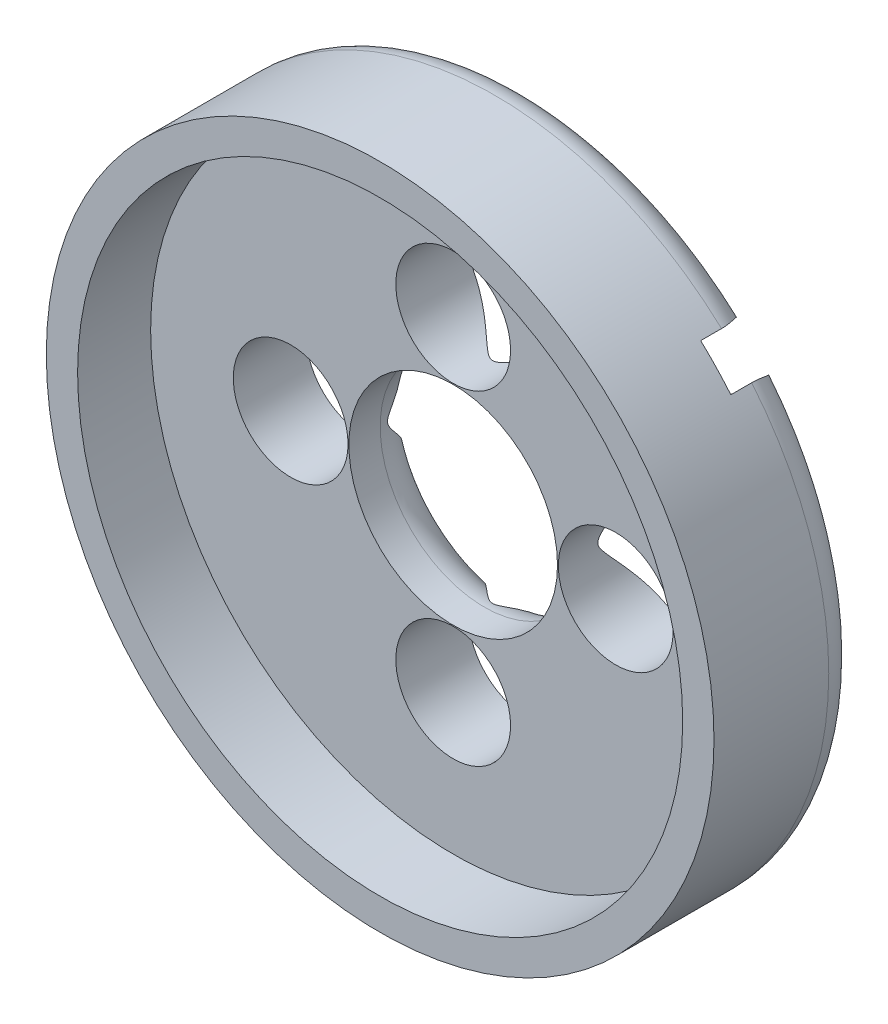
ISO-10303-21;
HEADER;
FILE_DESCRIPTION(('STEP AP214'),'2;1');
FILE_NAME('part.step','',(''),(''),'','','');
FILE_SCHEMA(('AUTOMOTIVE_DESIGN { 1 0 10303 214 1 1 1 1 }'));
ENDSEC;
DATA;
#1=APPLICATION_CONTEXT('core data for automotive mechanical design processes');
#2=APPLICATION_PROTOCOL_DEFINITION('international standard','automotive_design',2000,#1);
#3=PRODUCT_CONTEXT('',#1,'mechanical');
#4=PRODUCT('Part','Part','',(#3));
#5=PRODUCT_RELATED_PRODUCT_CATEGORY('part','',(#4));
#6=PRODUCT_DEFINITION_FORMATION('','',#4);
#7=PRODUCT_DEFINITION_CONTEXT('part definition',#1,'design');
#8=PRODUCT_DEFINITION('design','',#6,#7);
#9=PRODUCT_DEFINITION_SHAPE('','',#8);
#10=(LENGTH_UNIT() NAMED_UNIT(*) SI_UNIT(.MILLI.,.METRE.));
#11=(NAMED_UNIT(*) PLANE_ANGLE_UNIT() SI_UNIT($,.RADIAN.));
#12=(NAMED_UNIT(*) SI_UNIT($,.STERADIAN.) SOLID_ANGLE_UNIT());
#13=UNCERTAINTY_MEASURE_WITH_UNIT(LENGTH_MEASURE(1.E-05),#10,'distance_accuracy_value','');
#14=(GEOMETRIC_REPRESENTATION_CONTEXT(3) GLOBAL_UNCERTAINTY_ASSIGNED_CONTEXT((#13)) GLOBAL_UNIT_ASSIGNED_CONTEXT((#10,
#11,#12)) REPRESENTATION_CONTEXT('',''));
#15=CARTESIAN_POINT('',(0.,0.,0.));
#16=DIRECTION('',(0.,0.,1.));
#17=DIRECTION('',(1.,0.,0.));
#18=AXIS2_PLACEMENT_3D('',#15,#16,#17);
#19=CARTESIAN_POINT('',(0.,0.,0.));
#20=DIRECTION('',(0.,0.,1.));
#21=DIRECTION('',(1.,0.,0.));
#22=AXIS2_PLACEMENT_3D('',#19,#20,#21);
#23=PLANE('',#22);
#24=CARTESIAN_POINT('',(0.,0.,0.));
#25=DIRECTION('',(0.,0.,1.));
#26=DIRECTION('',(1.,0.,0.));
#27=AXIS2_PLACEMENT_3D('',#24,#25,#26);
#28=CIRCLE('',#27,10.);
#29=CARTESIAN_POINT('',(10.,0.,0.));
#30=VERTEX_POINT('',#29);
#31=EDGE_CURVE('E210',#30,#30,#28,.T.);
#32=ORIENTED_EDGE('',*,*,#31,.F.);
#33=EDGE_LOOP('',(#32));
#34=FACE_BOUND('',#33,.T.);
#35=CARTESIAN_POINT('',(0.,15.5782327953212,0.));
#36=DIRECTION('',(0.,0.,1.));
#37=DIRECTION('',(1.,0.,0.));
#38=AXIS2_PLACEMENT_3D('',#35,#36,#37);
#39=CIRCLE('',#38,5.5);
#40=CARTESIAN_POINT('',(5.5,15.5782327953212,0.));
#41=VERTEX_POINT('',#40);
#42=EDGE_CURVE('E204',#41,#41,#39,.T.);
#43=ORIENTED_EDGE('',*,*,#42,.F.);
#44=EDGE_LOOP('',(#43));
#45=FACE_BOUND('',#44,.T.);
#46=CARTESIAN_POINT('',(15.5782327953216,4.40852222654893E-13,0.));
#47=DIRECTION('',(0.,0.,1.));
#48=DIRECTION('',(1.,0.,0.));
#49=AXIS2_PLACEMENT_3D('',#46,#47,#48);
#50=CIRCLE('',#49,5.5);
#51=CARTESIAN_POINT('',(21.0782327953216,4.40852222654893E-13,0.));
#52=VERTEX_POINT('',#51);
#53=EDGE_CURVE('E198',#52,#52,#50,.T.);
#54=ORIENTED_EDGE('',*,*,#53,.F.);
#55=EDGE_LOOP('',(#54));
#56=FACE_BOUND('',#55,.T.);
#57=CARTESIAN_POINT('',(8.81704445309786E-13,-15.5782327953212,0.));
#58=DIRECTION('',(0.,0.,1.));
#59=DIRECTION('',(1.,0.,0.));
#60=AXIS2_PLACEMENT_3D('',#57,#58,#59);
#61=CIRCLE('',#60,5.5);
#62=CARTESIAN_POINT('',(5.50000000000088,-15.5782327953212,0.));
#63=VERTEX_POINT('',#62);
#64=EDGE_CURVE('E191',#63,#63,#61,.T.);
#65=ORIENTED_EDGE('',*,*,#64,.F.);
#66=EDGE_LOOP('',(#65));
#67=FACE_BOUND('',#66,.T.);
#68=CARTESIAN_POINT('',(-15.5782327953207,-4.42760005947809E-13,0.));
#69=DIRECTION('',(0.,0.,1.));
#70=DIRECTION('',(1.,0.,0.));
#71=AXIS2_PLACEMENT_3D('',#68,#69,#70);
#72=CIRCLE('',#71,5.5);
#73=CARTESIAN_POINT('',(-10.0782327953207,-4.42760005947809E-13,0.));
#74=VERTEX_POINT('',#73);
#75=EDGE_CURVE('E192',#74,#74,#72,.T.);
#76=ORIENTED_EDGE('',*,*,#75,.F.);
#77=EDGE_LOOP('',(#76));
#78=FACE_BOUND('',#77,.T.);
#79=CARTESIAN_POINT('',(18.5310177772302,17.4350973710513,0.));
#80=DIRECTION('',(0.,0.,1.));
#81=DIRECTION('',(1.,0.,0.));
#82=AXIS2_PLACEMENT_3D('',#79,#80,#81);
#83=CIRCLE('',#82,1.9999999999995);
#84=CARTESIAN_POINT('',(20.5310177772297,17.4350973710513,0.));
#85=VERTEX_POINT('',#84);
#86=EDGE_CURVE('E187',#85,#85,#83,.T.);
#87=ORIENTED_EDGE('',*,*,#86,.F.);
#88=EDGE_LOOP('',(#87));
#89=FACE_BOUND('',#88,.T.);
#90=CARTESIAN_POINT('',(0.,0.,0.));
#91=DIRECTION('',(0.,0.,1.));
#92=DIRECTION('',(1.,0.,0.));
#93=AXIS2_PLACEMENT_3D('',#90,#91,#92);
#94=CIRCLE('',#93,29.);
#95=CARTESIAN_POINT('',(29.,0.,0.));
#96=VERTEX_POINT('',#95);
#97=EDGE_CURVE('E223',#96,#96,#94,.F.);
#98=ORIENTED_EDGE('',*,*,#97,.F.);
#99=EDGE_LOOP('',(#98));
#100=FACE_BOUND('',#99,.T.);
#101=ADVANCED_FACE('F33',(#34,#45,#56,#67,#78,#89,#100),#23,.T.);
#102=CARTESIAN_POINT('',(0.,0.,-6.99999999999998));
#103=DIRECTION('',(0.,0.,1.));
#104=DIRECTION('',(1.,0.,0.));
#105=AXIS2_PLACEMENT_3D('',#102,#103,#104);
#106=CYLINDRICAL_SURFACE('',#105,32.);
#107=DIRECTION('',(0.,0.,-1.));
#108=VECTOR('',#107,1.);
#109=CARTESIAN_POINT('',(21.7247211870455,23.4954567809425,-4.49999999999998));
#110=LINE('',#109,#108);
#111=CARTESIAN_POINT('',(21.7247211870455,23.4954567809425,-3.99999999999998));
#112=VERTEX_POINT('',#111);
#113=CARTESIAN_POINT('',(21.7247211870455,23.4954567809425,-1.99999999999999));
#114=VERTEX_POINT('',#113);
#115=EDGE_CURVE('E182',#112,#114,#110,.F.);
#116=ORIENTED_EDGE('',*,*,#115,.F.);
#117=CARTESIAN_POINT('',(0.,0.,-3.99999999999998));
#118=DIRECTION('',(0.,0.,1.));
#119=DIRECTION('',(1.,0.,0.));
#120=AXIS2_PLACEMENT_3D('',#117,#118,#119);
#121=CIRCLE('',#120,32.);
#122=CARTESIAN_POINT('',(24.6149607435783,20.4475843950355,-3.99999999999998));
#123=VERTEX_POINT('',#122);
#124=EDGE_CURVE('E283',#112,#123,#121,.T.);
#125=ORIENTED_EDGE('',*,*,#124,.T.);
#126=DIRECTION('',(0.,0.,-1.));
#127=VECTOR('',#126,1.);
#128=CARTESIAN_POINT('',(24.6149607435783,20.4475843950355,-4.49999999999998));
#129=LINE('',#128,#127);
#130=CARTESIAN_POINT('',(24.6149607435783,20.4475843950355,-1.99999999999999));
#131=VERTEX_POINT('',#130);
#132=EDGE_CURVE('E179',#131,#123,#129,.T.);
#133=ORIENTED_EDGE('',*,*,#132,.F.);
#134=CARTESIAN_POINT('',(0.,0.,-1.99999999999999));
#135=DIRECTION('',(0.,0.,-1.));
#136=DIRECTION('',(-1.,0.,0.));
#137=AXIS2_PLACEMENT_3D('',#134,#135,#136);
#138=CIRCLE('',#137,32.);
#139=EDGE_CURVE('E172',#131,#114,#138,.F.);
#140=ORIENTED_EDGE('',*,*,#139,.T.);
#141=EDGE_LOOP('',(#116,#125,#133,#140));
#142=FACE_BOUND('',#141,.T.);
#143=CARTESIAN_POINT('',(0.,0.,7.));
#144=DIRECTION('',(0.,0.,1.));
#145=DIRECTION('',(1.,0.,0.));
#146=AXIS2_PLACEMENT_3D('',#143,#144,#145);
#147=CIRCLE('',#146,32.);
#148=CARTESIAN_POINT('',(32.,0.,7.));
#149=VERTEX_POINT('',#148);
#150=EDGE_CURVE('E335',#149,#149,#147,.T.);
#151=ORIENTED_EDGE('',*,*,#150,.F.);
#152=EDGE_LOOP('',(#151));
#153=FACE_BOUND('',#152,.T.);
#154=ADVANCED_FACE('F327',(#142,#153),#106,.T.);
#155=CARTESIAN_POINT('',(0.,0.,-6.99999999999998));
#156=DIRECTION('',(0.,0.,1.));
#157=DIRECTION('',(1.,0.,0.));
#158=AXIS2_PLACEMENT_3D('',#155,#156,#157);
#159=PLANE('',#158);
#160=CARTESIAN_POINT('',(0.,15.5782327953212,-6.99999999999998));
#161=DIRECTION('',(0.,0.,1.));
#162=DIRECTION('',(1.,0.,0.));
#163=AXIS2_PLACEMENT_3D('',#160,#161,#162);
#164=CIRCLE('',#163,5.5);
#165=CARTESIAN_POINT('',(4.91457875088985,13.1090394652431,-6.99999999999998));
#166=VERTEX_POINT('',#165);
#167=CARTESIAN_POINT('',(-4.91457875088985,13.1090394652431,-6.99999999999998));
#168=VERTEX_POINT('',#167);
#169=EDGE_CURVE('E207',#166,#168,#164,.T.);
#170=ORIENTED_EDGE('',*,*,#169,.T.);
#171=CARTESIAN_POINT('',(0.,0.,-6.99999999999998));
#172=DIRECTION('',(0.,0.,1.));
#173=DIRECTION('',(1.,0.,0.));
#174=AXIS2_PLACEMENT_3D('',#171,#172,#173);
#175=CIRCLE('',#174,14.);
#176=CARTESIAN_POINT('',(-13.1090394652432,4.91457875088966,-6.99999999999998));
#177=VERTEX_POINT('',#176);
#178=EDGE_CURVE('E232',#168,#177,#175,.T.);
#179=ORIENTED_EDGE('',*,*,#178,.T.);
#180=CARTESIAN_POINT('',(-15.5782327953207,-4.42760005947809E-13,-6.99999999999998));
#181=DIRECTION('',(0.,0.,1.));
#182=DIRECTION('',(1.,0.,0.));
#183=AXIS2_PLACEMENT_3D('',#180,#181,#182);
#184=CIRCLE('',#183,5.5);
#185=CARTESIAN_POINT('',(-13.1090394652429,-4.91457875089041,-6.99999999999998));
#186=VERTEX_POINT('',#185);
#187=EDGE_CURVE('E188',#177,#186,#184,.T.);
#188=ORIENTED_EDGE('',*,*,#187,.T.);
#189=CARTESIAN_POINT('',(0.,0.,-6.99999999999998));
#190=DIRECTION('',(0.,0.,1.));
#191=DIRECTION('',(1.,0.,0.));
#192=AXIS2_PLACEMENT_3D('',#189,#190,#191);
#193=CIRCLE('',#192,14.);
#194=CARTESIAN_POINT('',(-4.91457875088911,-13.1090394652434,-6.99999999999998));
#195=VERTEX_POINT('',#194);
#196=EDGE_CURVE('E230',#186,#195,#193,.T.);
#197=ORIENTED_EDGE('',*,*,#196,.T.);
#198=CARTESIAN_POINT('',(8.81704445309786E-13,-15.5782327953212,-6.99999999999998));
#199=DIRECTION('',(0.,0.,1.));
#200=DIRECTION('',(1.,0.,0.));
#201=AXIS2_PLACEMENT_3D('',#198,#199,#200);
#202=CIRCLE('',#201,5.5);
#203=CARTESIAN_POINT('',(4.91457875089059,-13.1090394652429,-6.99999999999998));
#204=VERTEX_POINT('',#203);
#205=EDGE_CURVE('E195',#195,#204,#202,.T.);
#206=ORIENTED_EDGE('',*,*,#205,.T.);
#207=CARTESIAN_POINT('',(0.,0.,-6.99999999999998));
#208=DIRECTION('',(0.,0.,1.));
#209=DIRECTION('',(1.,0.,0.));
#210=AXIS2_PLACEMENT_3D('',#207,#208,#209);
#211=CIRCLE('',#210,14.);
#212=CARTESIAN_POINT('',(13.1090394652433,-4.91457875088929,-6.99999999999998));
#213=VERTEX_POINT('',#212);
#214=EDGE_CURVE('E228',#204,#213,#211,.T.);
#215=ORIENTED_EDGE('',*,*,#214,.T.);
#216=CARTESIAN_POINT('',(15.5782327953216,4.40852222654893E-13,-6.99999999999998));
#217=DIRECTION('',(0.,0.,1.));
#218=DIRECTION('',(1.,0.,0.));
#219=AXIS2_PLACEMENT_3D('',#216,#217,#218);
#220=CIRCLE('',#219,5.5);
#221=CARTESIAN_POINT('',(13.1090394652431,4.91457875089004,-6.99999999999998));
#222=VERTEX_POINT('',#221);
#223=EDGE_CURVE('E201',#213,#222,#220,.T.);
#224=ORIENTED_EDGE('',*,*,#223,.T.);
#225=CARTESIAN_POINT('',(0.,0.,-6.99999999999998));
#226=DIRECTION('',(0.,0.,1.));
#227=DIRECTION('',(1.,0.,0.));
#228=AXIS2_PLACEMENT_3D('',#225,#226,#227);
#229=CIRCLE('',#228,14.);
#230=EDGE_CURVE('E226',#222,#166,#229,.T.);
#231=ORIENTED_EDGE('',*,*,#230,.T.);
#232=EDGE_LOOP('',(#170,#179,#188,#197,#206,#215,#224,#231));
#233=FACE_BOUND('',#232,.T.);
#234=DIRECTION('',(-0.707106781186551,-0.707106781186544,0.));
#235=VECTOR('',#234,1.);
#236=CARTESIAN_POINT('',(20.3150126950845,15.9843852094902,-6.99999999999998));
#237=LINE('',#236,#235);
#238=CARTESIAN_POINT('',(22.5567682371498,18.2261407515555,-6.99999999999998));
#239=VERTEX_POINT('',#238);
#240=CARTESIAN_POINT('',(20.3150126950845,15.9843852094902,-6.99999999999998));
#241=VERTEX_POINT('',#240);
#242=EDGE_CURVE('E144',#239,#241,#237,.T.);
#243=ORIENTED_EDGE('',*,*,#242,.F.);
#244=CARTESIAN_POINT('',(0.,0.,-6.99999999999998));
#245=DIRECTION('',(0.,0.,1.));
#246=DIRECTION('',(1.,0.,0.));
#247=AXIS2_PLACEMENT_3D('',#244,#245,#246);
#248=CIRCLE('',#247,29.);
#249=CARTESIAN_POINT('',(19.4862049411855,21.4776119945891,-6.99999999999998));
#250=VERTEX_POINT('',#249);
#251=EDGE_CURVE('E60',#239,#250,#248,.F.);
#252=ORIENTED_EDGE('',*,*,#251,.T.);
#253=DIRECTION('',(0.707106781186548,0.707106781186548,0.));
#254=VECTOR('',#253,1.);
#255=CARTESIAN_POINT('',(17.1539954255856,19.1454024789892,-6.99999999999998));
#256=LINE('',#255,#254);
#257=CARTESIAN_POINT('',(17.1539954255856,19.1454024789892,-6.99999999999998));
#258=VERTEX_POINT('',#257);
#259=EDGE_CURVE('E166',#258,#250,#256,.T.);
#260=ORIENTED_EDGE('',*,*,#259,.F.);
#261=CARTESIAN_POINT('',(18.7345040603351,17.5648938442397,-6.99999999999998));
#262=DIRECTION('',(0.,0.,-1.));
#263=DIRECTION('',(-1.,0.,0.));
#264=AXIS2_PLACEMENT_3D('',#261,#262,#263);
#265=CIRCLE('',#264,2.23517674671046);
#266=CARTESIAN_POINT('',(16.6375083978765,16.7911857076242,-6.99999999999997));
#267=VERTEX_POINT('',#266);
#268=EDGE_CURVE('E150',#267,#258,#265,.T.);
#269=ORIENTED_EDGE('',*,*,#268,.F.);
#270=CARTESIAN_POINT('',(18.5310177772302,17.4350973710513,-6.99999999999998));
#271=DIRECTION('',(0.,0.,-1.));
#272=DIRECTION('',(-1.,0.,0.));
#273=AXIS2_PLACEMENT_3D('',#270,#271,#272);
#274=CIRCLE('',#273,1.9999999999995);
#275=CARTESIAN_POINT('',(17.1488337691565,15.9895637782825,-6.99999999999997));
#276=VERTEX_POINT('',#275);
#277=EDGE_CURVE('E184',#276,#267,#274,.T.);
#278=ORIENTED_EDGE('',*,*,#277,.F.);
#279=EDGE_CURVE('E164',#241,#276,#265,.T.);
#280=ORIENTED_EDGE('',*,*,#279,.F.);
#281=EDGE_LOOP('',(#243,#252,#260,#269,#278,#280));
#282=FACE_BOUND('',#281,.T.);
#283=ADVANCED_FACE('F320',(#233,#282),#159,.F.);
#284=CARTESIAN_POINT('',(0.,0.,-6.99999999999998));
#285=DIRECTION('',(0.,0.,1.));
#286=DIRECTION('',(1.,0.,0.));
#287=AXIS2_PLACEMENT_3D('',#284,#285,#286);
#288=CYLINDRICAL_SURFACE('',#287,10.);
#289=CARTESIAN_POINT('',(0.,0.,-2.99999999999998));
#290=DIRECTION('',(0.,0.,1.));
#291=DIRECTION('',(1.,0.,0.));
#292=AXIS2_PLACEMENT_3D('',#289,#290,#291);
#293=CIRCLE('',#292,10.);
#294=CARTESIAN_POINT('',(10.,0.,-2.99999999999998));
#295=VERTEX_POINT('',#294);
#296=EDGE_CURVE('E280',#295,#295,#293,.F.);
#297=ORIENTED_EDGE('',*,*,#296,.T.);
#298=EDGE_LOOP('',(#297));
#299=FACE_BOUND('',#298,.T.);
#300=ORIENTED_EDGE('',*,*,#31,.T.);
#301=EDGE_LOOP('',(#300));
#302=FACE_BOUND('',#301,.T.);
#303=ADVANCED_FACE('F363',(#299,#302),#288,.F.);
#304=CARTESIAN_POINT('',(0.,15.5782327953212,-6.99999999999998));
#305=DIRECTION('',(0.,0.,1.));
#306=DIRECTION('',(1.,0.,0.));
#307=AXIS2_PLACEMENT_3D('',#304,#305,#306);
#308=CYLINDRICAL_SURFACE('',#307,5.5);
#309=ORIENTED_EDGE('',*,*,#169,.F.);
#310=CARTESIAN_POINT('',(4.91457875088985,13.1090394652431,-6.99999999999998));
#311=CARTESIAN_POINT('',(4.86752636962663,13.01533124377,-7.00002642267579));
#312=CARTESIAN_POINT('',(4.81776423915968,12.9230211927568,-6.99592508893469));
#313=CARTESIAN_POINT('',(4.71344321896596,12.7419888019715,-6.97983204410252));
#314=CARTESIAN_POINT('',(4.6588894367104,12.6532627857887,-6.96784864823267));
#315=CARTESIAN_POINT('',(4.54607410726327,12.480857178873,-6.93651286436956));
#316=CARTESIAN_POINT('',(4.48785516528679,12.3971359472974,-6.91723547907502));
#317=CARTESIAN_POINT('',(4.36784234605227,12.2342532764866,-6.87181078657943));
#318=CARTESIAN_POINT('',(4.30604768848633,12.1550928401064,-6.84566197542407));
#319=CARTESIAN_POINT('',(4.11673946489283,11.9256191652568,-6.75797865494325));
#320=CARTESIAN_POINT('',(3.9847483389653,11.7824788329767,-6.68704631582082));
#321=CARTESIAN_POINT('',(3.71297402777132,11.5161835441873,-6.52476375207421));
#322=CARTESIAN_POINT('',(3.57317022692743,11.3930851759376,-6.4333573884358));
#323=CARTESIAN_POINT('',(3.31452590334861,11.1866273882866,-6.2525436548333));
#324=CARTESIAN_POINT('',(3.19639057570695,11.100095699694,-6.16568412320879));
#325=CARTESIAN_POINT('',(2.95821665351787,10.9393084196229,-5.98350057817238));
#326=CARTESIAN_POINT('',(2.83817690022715,10.8650606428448,-5.88817123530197));
#327=CARTESIAN_POINT('',(2.59669765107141,10.7278209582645,-5.69083153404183));
#328=CARTESIAN_POINT('',(2.4752556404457,10.6648543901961,-5.58880682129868));
#329=CARTESIAN_POINT('',(2.23153186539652,10.5494710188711,-5.3800529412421));
#330=CARTESIAN_POINT('',(2.10925040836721,10.4970505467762,-5.27332542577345));
#331=CARTESIAN_POINT('',(1.88563360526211,10.4104414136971,-5.07627134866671));
#332=CARTESIAN_POINT('',(1.78447250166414,10.3746689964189,-4.98643399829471));
#333=CARTESIAN_POINT('',(1.58094213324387,10.3092618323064,-4.80580551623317));
#334=CARTESIAN_POINT('',(1.47857231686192,10.2796300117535,-4.71501395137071));
#335=CARTESIAN_POINT('',(1.27206291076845,10.2262954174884,-4.53427036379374));
#336=CARTESIAN_POINT('',(1.16792898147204,10.2025765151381,-4.4443167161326));
#337=CARTESIAN_POINT('',(1.00873149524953,10.171258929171,-4.3120856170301));
#338=CARTESIAN_POINT('',(0.955191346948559,10.1615333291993,-4.26847776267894));
#339=CARTESIAN_POINT('',(0.846616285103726,10.1435042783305,-4.18286871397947));
#340=CARTESIAN_POINT('',(0.791581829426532,10.1352003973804,-4.14086703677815));
#341=CARTESIAN_POINT('',(0.677809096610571,10.1198481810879,-4.05854035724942));
#342=CARTESIAN_POINT('',(0.619011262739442,10.1128390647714,-4.01828954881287));
#343=CARTESIAN_POINT('',(0.497862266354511,10.1004737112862,-3.94301569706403));
#344=CARTESIAN_POINT('',(0.435512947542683,10.0951166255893,-3.90798997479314));
#345=CARTESIAN_POINT('',(0.32718416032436,10.0878008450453,-3.85783814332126));
#346=CARTESIAN_POINT('',(0.282559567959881,10.0853038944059,-3.83995523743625));
#347=CARTESIAN_POINT('',(0.191130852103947,10.0813656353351,-3.81111943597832));
#348=CARTESIAN_POINT('',(0.14433508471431,10.0799205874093,-3.80014201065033));
#349=CARTESIAN_POINT('',(0.0487030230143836,10.0782389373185,-3.78731924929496));
#350=CARTESIAN_POINT('',(-0.000152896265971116,10.0780199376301,-3.78560694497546));
#351=CARTESIAN_POINT('',(-0.0971705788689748,10.078876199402,-3.7921785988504));
#352=CARTESIAN_POINT('',(-0.14533149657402,10.0799529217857,-3.80047384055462));
#353=CARTESIAN_POINT('',(-0.253134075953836,10.0837231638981,-3.82852635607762));
#354=CARTESIAN_POINT('',(-0.312033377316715,10.0867962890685,-3.8509186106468));
#355=CARTESIAN_POINT('',(-0.426214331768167,10.094470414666,-3.90359194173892));
#356=CARTESIAN_POINT('',(-0.481473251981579,10.0990800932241,-3.9339176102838));
#357=CARTESIAN_POINT('',(-0.58989965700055,10.1096843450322,-3.99949077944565));
#358=CARTESIAN_POINT('',(-0.643024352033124,10.1156983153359,-4.03480419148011));
#359=CARTESIAN_POINT('',(-0.747230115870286,10.1289758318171,-4.1081368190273));
#360=CARTESIAN_POINT('',(-0.798309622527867,10.1362403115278,-4.14615804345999));
#361=CARTESIAN_POINT('',(-0.949680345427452,10.1598756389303,-4.26275194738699));
#362=CARTESIAN_POINT('',(-1.04785270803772,10.1780626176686,-4.34368648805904));
#363=CARTESIAN_POINT('',(-1.24188399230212,10.2193553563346,-4.50804314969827));
#364=CARTESIAN_POINT('',(-1.33772775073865,10.2424868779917,-4.59147625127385));
#365=CARTESIAN_POINT('',(-1.52769748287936,10.2937462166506,-4.75849911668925));
#366=CARTESIAN_POINT('',(-1.62182555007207,10.3218674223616,-4.84208853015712));
#367=CARTESIAN_POINT('',(-1.87371832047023,10.4045539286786,-5.06564261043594));
#368=CARTESIAN_POINT('',(-2.03065886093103,10.4639922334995,-5.20478131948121));
#369=CARTESIAN_POINT('',(-2.34326584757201,10.5994667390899,-5.47669531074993));
#370=CARTESIAN_POINT('',(-2.49893090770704,10.6755190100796,-5.60946427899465));
#371=CARTESIAN_POINT('',(-2.80768186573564,10.8456021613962,-5.86420783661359));
#372=CARTESIAN_POINT('',(-2.96077742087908,10.9395277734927,-5.98623979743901));
#373=CARTESIAN_POINT('',(-3.26366829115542,11.1474132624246,-6.21616351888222));
#374=CARTESIAN_POINT('',(-3.41346829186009,11.2613423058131,-6.32407660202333));
#375=CARTESIAN_POINT('',(-3.70492655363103,11.5089161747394,-6.51957185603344));
#376=CARTESIAN_POINT('',(-3.84668067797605,11.6421870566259,-6.60747258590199));
#377=CARTESIAN_POINT('',(-4.05200339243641,11.8578668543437,-6.72177419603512));
#378=CARTESIAN_POINT('',(-4.11917057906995,11.9323169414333,-6.75692668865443));
#379=CARTESIAN_POINT('',(-4.25055131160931,12.0863790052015,-6.82079470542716));
#380=CARTESIAN_POINT('',(-4.31476641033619,12.1659882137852,-6.84951364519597));
#381=CARTESIAN_POINT('',(-4.42734147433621,12.3139544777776,-6.89494667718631));
#382=CARTESIAN_POINT('',(-4.47633697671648,12.3814476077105,-6.91291085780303));
#383=CARTESIAN_POINT('',(-4.57167680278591,12.5193448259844,-6.94400032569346));
#384=CARTESIAN_POINT('',(-4.61802174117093,12.5897482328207,-6.95712673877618));
#385=CARTESIAN_POINT('',(-4.70803314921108,12.7336478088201,-6.97836382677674));
#386=CARTESIAN_POINT('',(-4.75167984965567,12.8071613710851,-6.98644071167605));
#387=CARTESIAN_POINT('',(-4.83568284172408,12.9564870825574,-6.99726673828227));
#388=CARTESIAN_POINT('',(-4.87603699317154,13.0323006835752,-7.00001244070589));
#389=CARTESIAN_POINT('',(-4.91457875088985,13.1090394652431,-6.99999999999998));
#390=B_SPLINE_CURVE_WITH_KNOTS('',3,(#310,#311,#312,#313,#314,#315,#316,#317,#318,#319,#320,
#321,#322,#323,#324,#325,#326,#327,#328,#329,#330,#331,#332,#333,#334,#335,#336,#337,#338,#339,
#340,#341,#342,#343,#344,#345,#346,#347,#348,#349,#350,#351,#352,#353,#354,#355,#356,#357,#358,
#359,#360,#361,#362,#363,#364,#365,#366,#367,#368,#369,#370,#371,#372,#373,#374,#375,#376,#377,
#378,#379,#380,#381,#382,#383,#384,#385,#386,#387,#388,#389),.UNSPECIFIED.,.F.,.F.,(4,2,2,2,2,2,
2,2,2,2,2,2,2,2,2,2,2,2,2,2,2,2,2,2,2,2,2,2,2,2,2,2,2,2,2,2,2,2,2,4),(0.,0.314398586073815,
0.628466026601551,0.939388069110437,1.25037822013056,1.86935409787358,2.49004842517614,
3.00010604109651,3.51048690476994,4.02200018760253,4.53333521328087,4.95301654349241,
5.37289741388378,5.79162012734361,6.00079068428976,6.20989785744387,6.42456062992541,
6.63911296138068,6.78314895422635,6.92667036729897,7.07224714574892,7.21798821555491,
7.40618342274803,7.59546005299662,7.78752438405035,7.97973272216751,8.3650566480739,
8.75243934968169,9.13931255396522,9.79265491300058,10.4466320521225,11.0968704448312,
11.746115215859,12.3841620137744,12.7026280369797,13.0209245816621,13.2766586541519,
13.5323331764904,13.7897007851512,14.047234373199),.UNSPECIFIED.);
#391=EDGE_CURVE('E275',#166,#168,#390,.T.);
#392=ORIENTED_EDGE('',*,*,#391,.T.);
#393=EDGE_LOOP('',(#309,#392));
#394=FACE_BOUND('',#393,.T.);
#395=ORIENTED_EDGE('',*,*,#42,.T.);
#396=EDGE_LOOP('',(#395));
#397=FACE_BOUND('',#396,.T.);
#398=ADVANCED_FACE('F266',(#394,#397),#308,.F.);
#399=CARTESIAN_POINT('',(15.5782327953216,4.40852222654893E-13,-6.99999999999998));
#400=DIRECTION('',(0.,0.,1.));
#401=DIRECTION('',(1.,0.,0.));
#402=AXIS2_PLACEMENT_3D('',#399,#400,#401);
#403=CYLINDRICAL_SURFACE('',#402,5.5);
#404=ORIENTED_EDGE('',*,*,#223,.F.);
#405=CARTESIAN_POINT('',(13.1090394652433,-4.91457875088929,-6.99999999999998));
#406=CARTESIAN_POINT('',(13.0153312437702,-4.86752636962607,-7.00002642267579));
#407=CARTESIAN_POINT('',(12.923021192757,-4.81776423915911,-6.99592508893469));
#408=CARTESIAN_POINT('',(12.7419888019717,-4.71344321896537,-6.97983204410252));
#409=CARTESIAN_POINT('',(12.6532627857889,-4.65888943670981,-6.96784864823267));
#410=CARTESIAN_POINT('',(12.4808571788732,-4.54607410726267,-6.93651286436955));
#411=CARTESIAN_POINT('',(12.3971359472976,-4.48785516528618,-6.91723547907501));
#412=CARTESIAN_POINT('',(12.2342532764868,-4.36784234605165,-6.87181078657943));
#413=CARTESIAN_POINT('',(12.1550928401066,-4.3060476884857,-6.84566197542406));
#414=CARTESIAN_POINT('',(11.925619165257,-4.11673946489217,-6.75797865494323));
#415=CARTESIAN_POINT('',(11.7824788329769,-3.98474833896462,-6.6870463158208));
#416=CARTESIAN_POINT('',(11.5161835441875,-3.71297402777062,-6.5247637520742));
#417=CARTESIAN_POINT('',(11.3930851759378,-3.57317022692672,-6.43335738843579));
#418=CARTESIAN_POINT('',(11.1866273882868,-3.31452590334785,-6.25254365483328));
#419=CARTESIAN_POINT('',(11.1000956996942,-3.19639057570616,-6.16568412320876));
#420=CARTESIAN_POINT('',(10.9393084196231,-2.95821665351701,-5.98350057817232));
#421=CARTESIAN_POINT('',(10.865060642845,-2.83817690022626,-5.8881712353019));
#422=CARTESIAN_POINT('',(10.7278209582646,-2.59669765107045,-5.69083153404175));
#423=CARTESIAN_POINT('',(10.6648543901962,-2.4752556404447,-5.58880682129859));
#424=CARTESIAN_POINT('',(10.5494710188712,-2.23153186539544,-5.38005294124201));
#425=CARTESIAN_POINT('',(10.4970505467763,-2.1092504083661,-5.27332542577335));
#426=CARTESIAN_POINT('',(10.4104414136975,-1.88563360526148,-5.07627134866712));
#427=CARTESIAN_POINT('',(10.3746689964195,-1.78447250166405,-4.98643399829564));
#428=CARTESIAN_POINT('',(10.3092618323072,-1.58094213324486,-4.80580551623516));
#429=CARTESIAN_POINT('',(10.2796300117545,-1.47857231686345,-4.71501395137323));
#430=CARTESIAN_POINT('',(10.2262954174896,-1.27206291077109,-4.53427036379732));
#431=CARTESIAN_POINT('',(10.2025765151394,-1.16792898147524,-4.44431671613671));
#432=CARTESIAN_POINT('',(10.1712589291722,-1.00873149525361,-4.31208561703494));
#433=CARTESIAN_POINT('',(10.1615333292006,-0.955191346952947,-4.26847776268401));
#434=CARTESIAN_POINT('',(10.1435042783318,-0.846616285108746,-4.18286871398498));
#435=CARTESIAN_POINT('',(10.1352003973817,-0.791581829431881,-4.14086703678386));
#436=CARTESIAN_POINT('',(10.1198481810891,-0.677809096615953,-4.05854035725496));
#437=CARTESIAN_POINT('',(10.1128390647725,-0.6190112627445,-4.01828954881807));
#438=CARTESIAN_POINT('',(10.1004737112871,-0.497862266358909,-3.94301569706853));
#439=CARTESIAN_POINT('',(10.0951166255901,-0.435512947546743,-3.90798997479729));
#440=CARTESIAN_POINT('',(10.087800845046,-0.327184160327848,-3.85783814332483));
#441=CARTESIAN_POINT('',(10.0853038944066,-0.282559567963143,-3.8399552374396));
#442=CARTESIAN_POINT('',(10.0813656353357,-0.191130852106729,-3.81111943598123));
#443=CARTESIAN_POINT('',(10.0799205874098,-0.144335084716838,-3.80014201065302));
#444=CARTESIAN_POINT('',(10.078238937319,-0.0487030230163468,-3.78731924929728));
#445=CARTESIAN_POINT('',(10.0780199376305,0.000152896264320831,-3.78560694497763));
#446=CARTESIAN_POINT('',(10.0788761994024,0.0971705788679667,-3.79217859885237));
#447=CARTESIAN_POINT('',(10.0799529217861,0.145331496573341,-3.80047384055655));
#448=CARTESIAN_POINT('',(10.0837231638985,0.253134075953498,-3.82852635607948));
#449=CARTESIAN_POINT('',(10.0867962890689,0.312033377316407,-3.85091861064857));
#450=CARTESIAN_POINT('',(10.0944704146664,0.426214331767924,-3.90359194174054));
#451=CARTESIAN_POINT('',(10.0990800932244,0.481473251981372,-3.93391761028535));
#452=CARTESIAN_POINT('',(10.1096843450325,0.589899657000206,-3.99949077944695));
#453=CARTESIAN_POINT('',(10.1156983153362,0.643024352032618,-4.03480419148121));
#454=CARTESIAN_POINT('',(10.1289758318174,0.74723011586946,-4.10813681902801));
#455=CARTESIAN_POINT('',(10.136240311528,0.798309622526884,-4.1461580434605));
#456=CARTESIAN_POINT('',(10.1598756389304,0.949680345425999,-4.26275194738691));
#457=CARTESIAN_POINT('',(10.1780626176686,1.04785270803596,-4.34368648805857));
#458=CARTESIAN_POINT('',(10.2193553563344,1.24188399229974,-4.50804314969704));
#459=CARTESIAN_POINT('',(10.2424868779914,1.33772775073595,-4.59147625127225));
#460=CARTESIAN_POINT('',(10.29374621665,1.52769748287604,-4.75849911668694));
#461=CARTESIAN_POINT('',(10.3218674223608,1.62182555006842,-4.84208853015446));
#462=CARTESIAN_POINT('',(10.4045539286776,1.87371832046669,-5.06564261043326));
#463=CARTESIAN_POINT('',(10.4639922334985,2.03065886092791,-5.20478131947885));
#464=CARTESIAN_POINT('',(10.599466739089,2.34326584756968,-5.47669531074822));
#465=CARTESIAN_POINT('',(10.6755190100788,2.49893090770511,-5.60946427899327));
#466=CARTESIAN_POINT('',(10.8456021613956,2.80768186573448,-5.86420783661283));
#467=CARTESIAN_POINT('',(10.9395277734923,2.9607774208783,-5.98623979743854));
#468=CARTESIAN_POINT('',(11.1474132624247,3.26366829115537,-6.21616351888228));
#469=CARTESIAN_POINT('',(11.2613423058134,3.41346829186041,-6.32407660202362));
#470=CARTESIAN_POINT('',(11.50891617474,3.70492655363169,-6.51957185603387));
#471=CARTESIAN_POINT('',(11.6421870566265,3.8466806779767,-6.60747258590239));
#472=CARTESIAN_POINT('',(11.8578668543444,4.05200339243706,-6.72177419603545));
#473=CARTESIAN_POINT('',(11.932316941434,4.1191705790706,-6.75692668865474));
#474=CARTESIAN_POINT('',(12.0863790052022,4.25055131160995,-6.82079470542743));
#475=CARTESIAN_POINT('',(12.1659882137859,4.31476641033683,-6.84951364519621));
#476=CARTESIAN_POINT('',(12.3139544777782,4.4273414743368,-6.8949466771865));
#477=CARTESIAN_POINT('',(12.3814476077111,4.47633697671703,-6.91291085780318));
#478=CARTESIAN_POINT('',(12.5193448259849,4.57167680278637,-6.94400032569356));
#479=CARTESIAN_POINT('',(12.5897482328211,4.61802174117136,-6.95712673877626));
#480=CARTESIAN_POINT('',(12.7336478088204,4.70803314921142,-6.97836382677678));
#481=CARTESIAN_POINT('',(12.8071613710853,4.75167984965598,-6.98644071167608));
#482=CARTESIAN_POINT('',(12.9564870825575,4.83568284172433,-6.99726673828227));
#483=CARTESIAN_POINT('',(13.0323006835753,4.87603699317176,-7.00001244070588));
#484=CARTESIAN_POINT('',(13.1090394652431,4.91457875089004,-6.99999999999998));
#485=B_SPLINE_CURVE_WITH_KNOTS('',3,(#405,#406,#407,#408,#409,#410,#411,#412,#413,#414,#415,
#416,#417,#418,#419,#420,#421,#422,#423,#424,#425,#426,#427,#428,#429,#430,#431,#432,#433,#434,
#435,#436,#437,#438,#439,#440,#441,#442,#443,#444,#445,#446,#447,#448,#449,#450,#451,#452,#453,
#454,#455,#456,#457,#458,#459,#460,#461,#462,#463,#464,#465,#466,#467,#468,#469,#470,#471,#472,
#473,#474,#475,#476,#477,#478,#479,#480,#481,#482,#483,#484),.UNSPECIFIED.,.F.,.F.,(4,2,2,2,2,2,
2,2,2,2,2,2,2,2,2,2,2,2,2,2,2,2,2,2,2,2,2,2,2,2,2,2,2,2,2,2,2,2,2,4),(0.,0.314398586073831,
0.628466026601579,0.939388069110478,1.25037822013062,1.86935409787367,2.49004842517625,
3.00010604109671,3.51048690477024,4.02200018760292,4.53333521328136,4.95301654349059,
5.37289741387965,5.79162012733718,6.0007906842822,6.20989785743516,6.42456062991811,
6.6391129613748,6.78314895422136,6.92667036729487,7.07224714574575,7.21798821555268,
7.40618342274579,7.59546005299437,7.78752438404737,7.97973272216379,8.36505664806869,
8.75243934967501,9.13931255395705,9.79265491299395,10.4466320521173,11.0968704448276,
11.7461152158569,12.3841620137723,12.7026280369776,13.0209245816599,13.2766586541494,
13.5323331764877,13.7897007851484,14.0472343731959),.UNSPECIFIED.);
#486=EDGE_CURVE('E270',#213,#222,#485,.T.);
#487=ORIENTED_EDGE('',*,*,#486,.T.);
#488=EDGE_LOOP('',(#404,#487));
#489=FACE_BOUND('',#488,.T.);
#490=ORIENTED_EDGE('',*,*,#53,.T.);
#491=EDGE_LOOP('',(#490));
#492=FACE_BOUND('',#491,.T.);
#493=ADVANCED_FACE('F261',(#489,#492),#403,.F.);
#494=CARTESIAN_POINT('',(8.81704445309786E-13,-15.5782327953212,-6.99999999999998));
#495=DIRECTION('',(0.,0.,1.));
#496=DIRECTION('',(1.,0.,0.));
#497=AXIS2_PLACEMENT_3D('',#494,#495,#496);
#498=CYLINDRICAL_SURFACE('',#497,5.5);
#499=ORIENTED_EDGE('',*,*,#205,.F.);
#500=CARTESIAN_POINT('',(-4.91457875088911,-13.1090394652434,-6.99999999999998));
#501=CARTESIAN_POINT('',(-4.8675263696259,-13.0153312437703,-7.00002642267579));
#502=CARTESIAN_POINT('',(-4.81776423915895,-12.9230211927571,-6.99592508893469));
#503=CARTESIAN_POINT('',(-4.71344321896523,-12.7419888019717,-6.97983204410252));
#504=CARTESIAN_POINT('',(-4.65888943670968,-12.653262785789,-6.96784864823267));
#505=CARTESIAN_POINT('',(-4.54607410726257,-12.4808571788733,-6.93651286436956));
#506=CARTESIAN_POINT('',(-4.48785516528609,-12.3971359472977,-6.91723547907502));
#507=CARTESIAN_POINT('',(-4.36784234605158,-12.2342532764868,-6.87181078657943));
#508=CARTESIAN_POINT('',(-4.30604768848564,-12.1550928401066,-6.84566197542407));
#509=CARTESIAN_POINT('',(-4.11673946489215,-11.925619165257,-6.75797865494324));
#510=CARTESIAN_POINT('',(-3.98474833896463,-11.7824788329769,-6.68704631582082));
#511=CARTESIAN_POINT('',(-3.71297402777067,-11.5161835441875,-6.52476375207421));
#512=CARTESIAN_POINT('',(-3.57317022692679,-11.3930851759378,-6.4333573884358));
#513=CARTESIAN_POINT('',(-3.31452590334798,-11.1866273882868,-6.2525436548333));
#514=CARTESIAN_POINT('',(-3.19639057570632,-11.1000956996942,-6.16568412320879));
#515=CARTESIAN_POINT('',(-2.95821665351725,-10.9393084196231,-5.98350057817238));
#516=CARTESIAN_POINT('',(-2.83817690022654,-10.865060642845,-5.88817123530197));
#517=CARTESIAN_POINT('',(-2.5966976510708,-10.7278209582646,-5.69083153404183));
#518=CARTESIAN_POINT('',(-2.47525564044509,-10.6648543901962,-5.58880682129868));
#519=CARTESIAN_POINT('',(-2.23153186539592,-10.5494710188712,-5.3800529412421));
#520=CARTESIAN_POINT('',(-2.10925040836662,-10.4970505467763,-5.27332542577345));
#521=CARTESIAN_POINT('',(-1.88563360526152,-10.4104414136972,-5.07627134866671));
#522=CARTESIAN_POINT('',(-1.78447250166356,-10.374668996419,-4.98643399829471));
#523=CARTESIAN_POINT('',(-1.58094213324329,-10.3092618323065,-4.80580551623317));
#524=CARTESIAN_POINT('',(-1.47857231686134,-10.2796300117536,-4.71501395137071));
#525=CARTESIAN_POINT('',(-1.27206291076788,-10.2262954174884,-4.53427036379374));
#526=CARTESIAN_POINT('',(-1.16792898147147,-10.2025765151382,-4.44431671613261));
#527=CARTESIAN_POINT('',(-1.00873149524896,-10.171258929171,-4.31208561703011));
#528=CARTESIAN_POINT('',(-0.955191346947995,-10.1615333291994,-4.26847776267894));
#529=CARTESIAN_POINT('',(-0.846616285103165,-10.1435042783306,-4.18286871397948));
#530=CARTESIAN_POINT('',(-0.791581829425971,-10.1352003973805,-4.14086703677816));
#531=CARTESIAN_POINT('',(-0.677809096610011,-10.119848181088,-4.05854035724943));
#532=CARTESIAN_POINT('',(-0.619011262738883,-10.1128390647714,-4.01828954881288));
#533=CARTESIAN_POINT('',(-0.497862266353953,-10.1004737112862,-3.94301569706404));
#534=CARTESIAN_POINT('',(-0.435512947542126,-10.0951166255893,-3.90798997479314));
#535=CARTESIAN_POINT('',(-0.327184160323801,-10.0878008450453,-3.85783814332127));
#536=CARTESIAN_POINT('',(-0.28255956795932,-10.0853038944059,-3.83995523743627));
#537=CARTESIAN_POINT('',(-0.191130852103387,-10.0813656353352,-3.81111943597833));
#538=CARTESIAN_POINT('',(-0.144335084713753,-10.0799205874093,-3.80014201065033));
#539=CARTESIAN_POINT('',(-0.0487030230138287,-10.0782389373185,-3.78731924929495));
#540=CARTESIAN_POINT('',(0.00015289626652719,-10.0780199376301,-3.78560694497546));
#541=CARTESIAN_POINT('',(0.0971705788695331,-10.0788761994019,-3.7921785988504));
#542=CARTESIAN_POINT('',(0.145331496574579,-10.0799529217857,-3.80047384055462));
#543=CARTESIAN_POINT('',(0.253134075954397,-10.0837231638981,-3.82852635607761));
#544=CARTESIAN_POINT('',(0.312033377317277,-10.0867962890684,-3.85091861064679));
#545=CARTESIAN_POINT('',(0.426214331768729,-10.094470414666,-3.90359194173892));
#546=CARTESIAN_POINT('',(0.481473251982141,-10.099080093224,-3.9339176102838));
#547=CARTESIAN_POINT('',(0.589899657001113,-10.1096843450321,-3.99949077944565));
#548=CARTESIAN_POINT('',(0.643024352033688,-10.1156983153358,-4.03480419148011));
#549=CARTESIAN_POINT('',(0.747230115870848,-10.1289758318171,-4.10813681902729));
#550=CARTESIAN_POINT('',(0.798309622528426,-10.1362403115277,-4.14615804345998));
#551=CARTESIAN_POINT('',(0.949680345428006,-10.1598756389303,-4.26275194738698));
#552=CARTESIAN_POINT('',(1.04785270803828,-10.1780626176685,-4.34368648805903));
#553=CARTESIAN_POINT('',(1.24188399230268,-10.2193553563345,-4.50804314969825));
#554=CARTESIAN_POINT('',(1.3377277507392,-10.2424868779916,-4.59147625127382));
#555=CARTESIAN_POINT('',(1.52769748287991,-10.2937462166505,-4.75849911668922));
#556=CARTESIAN_POINT('',(1.62182555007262,-10.3218674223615,-4.84208853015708));
#557=CARTESIAN_POINT('',(1.87371832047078,-10.4045539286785,-5.0656426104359));
#558=CARTESIAN_POINT('',(2.03065886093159,-10.4639922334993,-5.20478131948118));
#559=CARTESIAN_POINT('',(2.34326584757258,-10.5994667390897,-5.47669531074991));
#560=CARTESIAN_POINT('',(2.49893090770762,-10.6755190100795,-5.60946427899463));
#561=CARTESIAN_POINT('',(2.80768186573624,-10.845602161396,-5.86420783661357));
#562=CARTESIAN_POINT('',(2.96077742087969,-10.9395277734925,-5.986239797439));
#563=CARTESIAN_POINT('',(3.26366829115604,-11.1474132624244,-6.21616351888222));
#564=CARTESIAN_POINT('',(3.41346829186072,-11.2613423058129,-6.32407660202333));
#565=CARTESIAN_POINT('',(3.70492655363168,-11.5089161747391,-6.51957185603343));
#566=CARTESIAN_POINT('',(3.8466806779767,-11.6421870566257,-6.60747258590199));
#567=CARTESIAN_POINT('',(4.05200339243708,-11.8578668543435,-6.72177419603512));
#568=CARTESIAN_POINT('',(4.11917057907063,-11.932316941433,-6.75692668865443));
#569=CARTESIAN_POINT('',(4.25055131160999,-12.0863790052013,-6.82079470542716));
#570=CARTESIAN_POINT('',(4.31476641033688,-12.1659882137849,-6.84951364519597));
#571=CARTESIAN_POINT('',(4.42734147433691,-12.3139544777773,-6.89494667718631));
#572=CARTESIAN_POINT('',(4.47633697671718,-12.3814476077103,-6.91291085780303));
#573=CARTESIAN_POINT('',(4.57167680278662,-12.5193448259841,-6.94400032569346));
#574=CARTESIAN_POINT('',(4.61802174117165,-12.5897482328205,-6.95712673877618));
#575=CARTESIAN_POINT('',(4.7080331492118,-12.7336478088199,-6.97836382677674));
#576=CARTESIAN_POINT('',(4.7516798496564,-12.8071613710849,-6.98644071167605));
#577=CARTESIAN_POINT('',(4.83568284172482,-12.9564870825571,-6.99726673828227));
#578=CARTESIAN_POINT('',(4.87603699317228,-13.032300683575,-7.00001244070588));
#579=CARTESIAN_POINT('',(4.91457875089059,-13.1090394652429,-6.99999999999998));
#580=B_SPLINE_CURVE_WITH_KNOTS('',3,(#500,#501,#502,#503,#504,#505,#506,#507,#508,#509,#510,
#511,#512,#513,#514,#515,#516,#517,#518,#519,#520,#521,#522,#523,#524,#525,#526,#527,#528,#529,
#530,#531,#532,#533,#534,#535,#536,#537,#538,#539,#540,#541,#542,#543,#544,#545,#546,#547,#548,
#549,#550,#551,#552,#553,#554,#555,#556,#557,#558,#559,#560,#561,#562,#563,#564,#565,#566,#567,
#568,#569,#570,#571,#572,#573,#574,#575,#576,#577,#578,#579),.UNSPECIFIED.,.F.,.F.,(4,2,2,2,2,2,
2,2,2,2,2,2,2,2,2,2,2,2,2,2,2,2,2,2,2,2,2,2,2,2,2,2,2,2,2,2,2,2,2,4),(0.,0.314398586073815,
0.628466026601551,0.939388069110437,1.25037822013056,1.86935409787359,2.49004842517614,
3.00010604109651,3.51048690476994,4.02200018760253,4.53333521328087,4.95301654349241,
5.37289741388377,5.7916201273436,6.00079068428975,6.20989785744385,6.42456062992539,
6.63911296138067,6.78314895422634,6.92667036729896,7.07224714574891,7.2179882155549,
7.40618342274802,7.59546005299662,7.78752438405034,7.97973272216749,8.36505664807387,
8.75243934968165,9.13931255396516,9.79265491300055,10.4466320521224,11.0968704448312,
11.746115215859,12.3841620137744,12.7026280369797,13.0209245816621,13.2766586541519,
13.5323331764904,13.7897007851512,14.047234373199),.UNSPECIFIED.);
#581=EDGE_CURVE('E241',#195,#204,#580,.T.);
#582=ORIENTED_EDGE('',*,*,#581,.T.);
#583=EDGE_LOOP('',(#499,#582));
#584=FACE_BOUND('',#583,.T.);
#585=ORIENTED_EDGE('',*,*,#64,.T.);
#586=EDGE_LOOP('',(#585));
#587=FACE_BOUND('',#586,.T.);
#588=ADVANCED_FACE('F255',(#584,#587),#498,.F.);
#589=CARTESIAN_POINT('',(-15.5782327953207,-4.42760005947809E-13,-6.99999999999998));
#590=DIRECTION('',(0.,0.,1.));
#591=DIRECTION('',(1.,0.,0.));
#592=AXIS2_PLACEMENT_3D('',#589,#590,#591);
#593=CYLINDRICAL_SURFACE('',#592,5.5);
#594=ORIENTED_EDGE('',*,*,#187,.F.);
#595=CARTESIAN_POINT('',(-13.1090394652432,4.91457875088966,-6.99999999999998));
#596=CARTESIAN_POINT('',(-13.0153312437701,4.86752636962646,-7.00002642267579));
#597=CARTESIAN_POINT('',(-12.9230211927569,4.81776423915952,-6.9959250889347));
#598=CARTESIAN_POINT('',(-12.7419888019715,4.71344321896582,-6.97983204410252));
#599=CARTESIAN_POINT('',(-12.6532627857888,4.65888943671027,-6.96784864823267));
#600=CARTESIAN_POINT('',(-12.4808571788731,4.54607410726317,-6.93651286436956));
#601=CARTESIAN_POINT('',(-12.3971359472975,4.4878551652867,-6.91723547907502));
#602=CARTESIAN_POINT('',(-12.2342532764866,4.36784234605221,-6.87181078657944));
#603=CARTESIAN_POINT('',(-12.1550928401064,4.30604768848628,-6.84566197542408));
#604=CARTESIAN_POINT('',(-11.9256191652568,4.11673946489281,-6.75797865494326));
#605=CARTESIAN_POINT('',(-11.7824788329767,3.9847483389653,-6.68704631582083));
#606=CARTESIAN_POINT('',(-11.5161835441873,3.71297402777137,-6.52476375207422));
#607=CARTESIAN_POINT('',(-11.3930851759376,3.57317022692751,-6.43335738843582));
#608=CARTESIAN_POINT('',(-11.1866273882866,3.31452590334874,-6.25254365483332));
#609=CARTESIAN_POINT('',(-11.100095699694,3.19639057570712,-6.16568412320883));
#610=CARTESIAN_POINT('',(-10.9393084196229,2.95821665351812,-5.98350057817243));
#611=CARTESIAN_POINT('',(-10.8650606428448,2.83817690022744,-5.88817123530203));
#612=CARTESIAN_POINT('',(-10.7278209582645,2.59669765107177,-5.69083153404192));
#613=CARTESIAN_POINT('',(-10.6648543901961,2.4752556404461,-5.58880682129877));
#614=CARTESIAN_POINT('',(-10.549471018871,2.231531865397,-5.3800529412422));
#615=CARTESIAN_POINT('',(-10.4970505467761,2.10925040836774,-5.27332542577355));
#616=CARTESIAN_POINT('',(-10.4104414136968,1.88563360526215,-5.07627134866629));
#617=CARTESIAN_POINT('',(-10.3746689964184,1.78447250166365,-4.98643399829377));
#618=CARTESIAN_POINT('',(-10.3092618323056,1.58094213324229,-4.80580551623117));
#619=CARTESIAN_POINT('',(-10.2796300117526,1.4785723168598,-4.71501395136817));
#620=CARTESIAN_POINT('',(-10.2262954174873,1.27206291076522,-4.53427036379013));
#621=CARTESIAN_POINT('',(-10.202576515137,1.16792898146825,-4.44431671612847));
#622=CARTESIAN_POINT('',(-10.1712589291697,1.00873149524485,-4.31208561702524));
#623=CARTESIAN_POINT('',(-10.1615333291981,0.955191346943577,-4.26847776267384));
#624=CARTESIAN_POINT('',(-10.1435042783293,0.846616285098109,-4.18286871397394));
#625=CARTESIAN_POINT('',(-10.1352003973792,0.791581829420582,-4.14086703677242));
#626=CARTESIAN_POINT('',(-10.1198481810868,0.677809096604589,-4.05854035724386));
#627=CARTESIAN_POINT('',(-10.1128390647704,0.619011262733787,-4.01828954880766));
#628=CARTESIAN_POINT('',(-10.1004737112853,0.497862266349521,-3.94301569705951));
#629=CARTESIAN_POINT('',(-10.0951166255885,0.435512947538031,-3.90798997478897));
#630=CARTESIAN_POINT('',(-10.0878008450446,0.327184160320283,-3.85783814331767));
#631=CARTESIAN_POINT('',(-10.0853038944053,0.28255956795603,-3.8399552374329));
#632=CARTESIAN_POINT('',(-10.0813656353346,0.19113085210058,-3.81111943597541));
#633=CARTESIAN_POINT('',(-10.0799205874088,0.1443350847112,-3.80014201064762));
#634=CARTESIAN_POINT('',(-10.078238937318,0.0487030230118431,-3.78731924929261));
#635=CARTESIAN_POINT('',(-10.0780199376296,-0.000152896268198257,-3.78560694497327));
#636=CARTESIAN_POINT('',(-10.0788761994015,-0.097170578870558,-3.79217859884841));
#637=CARTESIAN_POINT('',(-10.0799529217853,-0.145331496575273,-3.80047384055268));
#638=CARTESIAN_POINT('',(-10.0837231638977,-0.253134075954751,-3.82852635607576));
#639=CARTESIAN_POINT('',(-10.086796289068,-0.312033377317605,-3.85091861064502));
#640=CARTESIAN_POINT('',(-10.0944704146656,-0.426214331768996,-3.90359194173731));
#641=CARTESIAN_POINT('',(-10.0990800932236,-0.481473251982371,-3.93391761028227));
#642=CARTESIAN_POINT('',(-10.1096843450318,-0.589899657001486,-3.99949077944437));
#643=CARTESIAN_POINT('',(-10.1156983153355,-0.643024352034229,-4.03480419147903));
#644=CARTESIAN_POINT('',(-10.1289758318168,-0.747230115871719,-4.10813681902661));
#645=CARTESIAN_POINT('',(-10.1362403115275,-0.798309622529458,-4.14615804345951));
#646=CARTESIAN_POINT('',(-10.1598756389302,-0.949680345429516,-4.2627519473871));
#647=CARTESIAN_POINT('',(-10.1780626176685,-1.0478527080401,-4.34368648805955));
#648=CARTESIAN_POINT('',(-10.2193553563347,-1.24188399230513,-4.50804314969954));
#649=CARTESIAN_POINT('',(-10.242486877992,-1.33772775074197,-4.59147625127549));
#650=CARTESIAN_POINT('',(-10.2937462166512,-1.52769748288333,-4.75849911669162));
#651=CARTESIAN_POINT('',(-10.3218674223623,-1.62182555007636,-4.84208853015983));
#652=CARTESIAN_POINT('',(-10.4045539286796,-1.87371832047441,-5.06564261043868));
#653=CARTESIAN_POINT('',(-10.4639922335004,-2.0306588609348,-5.20478131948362));
#654=CARTESIAN_POINT('',(-10.5994667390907,-2.34326584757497,-5.47669531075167));
#655=CARTESIAN_POINT('',(-10.6755190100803,-2.49893090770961,-5.60946427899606));
#656=CARTESIAN_POINT('',(-10.8456021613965,-2.80768186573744,-5.86420783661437));
#657=CARTESIAN_POINT('',(-10.9395277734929,-2.96077742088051,-5.9862397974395));
#658=CARTESIAN_POINT('',(-11.1474132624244,-3.26366829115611,-6.21616351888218));
#659=CARTESIAN_POINT('',(-11.2613423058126,-3.41346829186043,-6.32407660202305));
#660=CARTESIAN_POINT('',(-11.5089161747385,-3.70492655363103,-6.519571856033));
#661=CARTESIAN_POINT('',(-11.642187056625,-3.84668067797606,-6.6074725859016));
#662=CARTESIAN_POINT('',(-11.8578668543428,-4.05200339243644,-6.72177419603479));
#663=CARTESIAN_POINT('',(-11.9323169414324,-4.11917057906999,-6.75692668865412));
#664=CARTESIAN_POINT('',(-12.0863790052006,-4.25055131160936,-6.8207947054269));
#665=CARTESIAN_POINT('',(-12.1659882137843,-4.31476641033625,-6.84951364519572));
#666=CARTESIAN_POINT('',(-12.3139544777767,-4.42734147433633,-6.89494667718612));
#667=CARTESIAN_POINT('',(-12.3814476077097,-4.47633697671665,-6.91291085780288));
#668=CARTESIAN_POINT('',(-12.5193448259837,-4.57167680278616,-6.94400032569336));
#669=CARTESIAN_POINT('',(-12.5897482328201,-4.61802174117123,-6.95712673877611));
#670=CARTESIAN_POINT('',(-12.7336478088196,-4.70803314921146,-6.9783638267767));
#671=CARTESIAN_POINT('',(-12.8071613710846,-4.75167984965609,-6.98644071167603));
#672=CARTESIAN_POINT('',(-12.9564870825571,-4.83568284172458,-6.99726673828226));
#673=CARTESIAN_POINT('',(-13.032300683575,-4.87603699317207,-7.00001244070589));
#674=CARTESIAN_POINT('',(-13.1090394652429,-4.91457875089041,-6.99999999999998));
#675=B_SPLINE_CURVE_WITH_KNOTS('',3,(#595,#596,#597,#598,#599,#600,#601,#602,#603,#604,#605,
#606,#607,#608,#609,#610,#611,#612,#613,#614,#615,#616,#617,#618,#619,#620,#621,#622,#623,#624,
#625,#626,#627,#628,#629,#630,#631,#632,#633,#634,#635,#636,#637,#638,#639,#640,#641,#642,#643,
#644,#645,#646,#647,#648,#649,#650,#651,#652,#653,#654,#655,#656,#657,#658,#659,#660,#661,#662,
#663,#664,#665,#666,#667,#668,#669,#670,#671,#672,#673,#674),.UNSPECIFIED.,.F.,.F.,(4,2,2,2,2,2,
2,2,2,2,2,2,2,2,2,2,2,2,2,2,2,2,2,2,2,2,2,2,2,2,2,2,2,2,2,2,2,2,2,4),(0.,0.314398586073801,
0.628466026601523,0.939388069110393,1.2503782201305,1.8693540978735,2.49004842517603,
3.0001060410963,3.51048690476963,4.02200018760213,4.53333521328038,4.95301654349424,
5.37289741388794,5.79162012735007,6.00079068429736,6.2098978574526,6.42456062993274,
6.6391129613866,6.78314895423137,6.9266703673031,7.0722471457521,7.21798821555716,
7.40618342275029,7.5954600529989,7.78752438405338,7.97973272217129,8.36505664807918,
8.75243934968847,9.13931255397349,9.79265491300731,10.4466320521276,11.0968704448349,
11.7461152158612,12.3841620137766,12.7026280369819,13.0209245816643,13.2766586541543,
13.532333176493,13.7897007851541,14.0472343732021),.UNSPECIFIED.);
#676=EDGE_CURVE('E235',#177,#186,#675,.T.);
#677=ORIENTED_EDGE('',*,*,#676,.T.);
#678=EDGE_LOOP('',(#594,#677));
#679=FACE_BOUND('',#678,.T.);
#680=ORIENTED_EDGE('',*,*,#75,.T.);
#681=EDGE_LOOP('',(#680));
#682=FACE_BOUND('',#681,.T.);
#683=ADVANCED_FACE('F250',(#679,#682),#593,.F.);
#684=CARTESIAN_POINT('',(18.5310177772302,17.4350973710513,8.00000000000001));
#685=DIRECTION('',(0.,0.,-1.));
#686=DIRECTION('',(-1.,0.,0.));
#687=AXIS2_PLACEMENT_3D('',#684,#685,#686);
#688=CYLINDRICAL_SURFACE('',#687,1.9999999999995);
#689=ORIENTED_EDGE('',*,*,#86,.T.);
#690=EDGE_LOOP('',(#689));
#691=FACE_BOUND('',#690,.T.);
#692=CARTESIAN_POINT('',(18.5310177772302,17.4350973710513,-1.99999999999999));
#693=DIRECTION('',(0.,0.,-1.));
#694=DIRECTION('',(-1.,0.,0.));
#695=AXIS2_PLACEMENT_3D('',#692,#693,#694);
#696=CIRCLE('',#695,1.9999999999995);
#697=CARTESIAN_POINT('',(17.1488337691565,15.9895637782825,-1.99999999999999));
#698=VERTEX_POINT('',#697);
#699=CARTESIAN_POINT('',(16.6375083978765,16.7911857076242,-1.99999999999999));
#700=VERTEX_POINT('',#699);
#701=EDGE_CURVE('E140',#698,#700,#696,.F.);
#702=ORIENTED_EDGE('',*,*,#701,.F.);
#703=DIRECTION('',(0.,0.,-1.));
#704=VECTOR('',#703,1.);
#705=CARTESIAN_POINT('',(17.1488337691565,15.9895637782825,-4.49999999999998));
#706=LINE('',#705,#704);
#707=EDGE_CURVE('E220',#698,#276,#706,.T.);
#708=ORIENTED_EDGE('',*,*,#707,.T.);
#709=ORIENTED_EDGE('',*,*,#277,.T.);
#710=DIRECTION('',(0.,0.,-1.));
#711=VECTOR('',#710,1.);
#712=CARTESIAN_POINT('',(16.6375083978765,16.7911857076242,-4.49999999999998));
#713=LINE('',#712,#711);
#714=EDGE_CURVE('E218',#267,#700,#713,.F.);
#715=ORIENTED_EDGE('',*,*,#714,.T.);
#716=EDGE_LOOP('',(#702,#708,#709,#715));
#717=FACE_BOUND('',#716,.T.);
#718=ADVANCED_FACE('F254',(#691,#717),#688,.F.);
#719=CARTESIAN_POINT('',(22.6147224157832,21.4451121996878,-1.99999999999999));
#720=DIRECTION('',(0.,0.,-1.));
#721=DIRECTION('',(-1.,0.,0.));
#722=AXIS2_PLACEMENT_3D('',#719,#720,#721);
#723=CYLINDRICAL_SURFACE('',#722,2.23517674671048);
#724=DIRECTION('',(0.,0.,-1.));
#725=VECTOR('',#724,1.);
#726=CARTESIAN_POINT('',(21.0342137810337,23.0256208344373,-1.99999999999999));
#727=LINE('',#726,#725);
#728=CARTESIAN_POINT('',(21.0342137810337,23.0256208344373,-1.99999999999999));
#729=VERTEX_POINT('',#728);
#730=CARTESIAN_POINT('',(21.0342137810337,23.0256208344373,-6.05373921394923));
#731=VERTEX_POINT('',#730);
#732=EDGE_CURVE('E151',#729,#731,#727,.T.);
#733=ORIENTED_EDGE('',*,*,#732,.T.);
#734=CARTESIAN_POINT('',(21.0342137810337,23.0256208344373,-6.05373921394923));
#735=CARTESIAN_POINT('',(21.0805521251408,23.0719409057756,-5.98406472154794));
#736=CARTESIAN_POINT('',(21.1265481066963,23.1138829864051,-5.91136765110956));
#737=CARTESIAN_POINT('',(21.216297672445,23.1897863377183,-5.76070481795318));
#738=CARTESIAN_POINT('',(21.2600531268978,23.2237543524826,-5.68274357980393));
#739=CARTESIAN_POINT('',(21.3439693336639,23.2846488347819,-5.52197530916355));
#740=CARTESIAN_POINT('',(21.3841192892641,23.3115545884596,-5.43915487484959));
#741=CARTESIAN_POINT('',(21.459338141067,23.3590301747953,-5.26948155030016));
#742=CARTESIAN_POINT('',(21.4944069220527,23.3795998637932,-5.18262856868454));
#743=CARTESIAN_POINT('',(21.553713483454,23.4126638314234,-5.01798346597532));
#744=CARTESIAN_POINT('',(21.5787808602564,23.4258869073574,-4.94063448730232));
#745=CARTESIAN_POINT('',(21.6235050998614,23.4486426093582,-4.7838603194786));
#746=CARTESIAN_POINT('',(21.6431628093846,23.4581758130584,-4.70443545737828));
#747=CARTESIAN_POINT('',(21.6763771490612,23.4738704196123,-4.54432466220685));
#748=CARTESIAN_POINT('',(21.6899577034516,23.4800450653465,-4.46364499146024));
#749=CARTESIAN_POINT('',(21.71065542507,23.4893256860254,-4.30131921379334));
#750=CARTESIAN_POINT('',(21.717776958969,23.4924337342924,-4.21967379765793));
#751=CARTESIAN_POINT('',(21.7226038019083,23.4945363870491,-4.11491171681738));
#752=CARTESIAN_POINT('',(21.7233976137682,23.4948817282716,-4.09193517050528));
#753=CARTESIAN_POINT('',(21.7244561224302,23.4953418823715,-4.04597324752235));
#754=CARTESIAN_POINT('',(21.724720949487,23.4954567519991,-4.02298787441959));
#755=CARTESIAN_POINT('',(21.7247211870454,23.4954567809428,-3.99999999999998));
#756=B_SPLINE_CURVE_WITH_KNOTS('',3,(#734,#735,#736,#737,#738,#739,#740,#741,#742,#743,#744,
#745,#746,#747,#748,#749,#750,#751,#752,#753,#754,#755),.UNSPECIFIED.,.F.,.F.,(4,2,2,2,2,2,2,2,
2,2,4),(0.,0.286660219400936,0.57307711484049,0.860324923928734,1.14757924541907,
1.39444264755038,1.6412673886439,1.8871117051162,2.13278969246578,2.20176349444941,
2.27072031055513),.UNSPECIFIED.);
#757=EDGE_CURVE('E11',#731,#112,#756,.T.);
#758=ORIENTED_EDGE('',*,*,#757,.T.);
#759=ORIENTED_EDGE('',*,*,#115,.T.);
#760=CARTESIAN_POINT('',(22.6147224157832,21.4451121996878,-1.99999999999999));
#761=DIRECTION('',(0.,0.,-1.));
#762=DIRECTION('',(-1.,0.,0.));
#763=AXIS2_PLACEMENT_3D('',#760,#761,#762);
#764=CIRCLE('',#763,2.23517674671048);
#765=EDGE_CURVE('E158',#729,#114,#764,.T.);
#766=ORIENTED_EDGE('',*,*,#765,.F.);
#767=EDGE_LOOP('',(#733,#758,#759,#766));
#768=FACE_BOUND('',#767,.T.);
#769=ADVANCED_FACE('F303',(#768),#723,.F.);
#770=CARTESIAN_POINT('',(18.7345040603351,17.5648938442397,-1.99999999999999));
#771=DIRECTION('',(0.,0.,-1.));
#772=DIRECTION('',(-1.,0.,0.));
#773=AXIS2_PLACEMENT_3D('',#770,#771,#772);
#774=CYLINDRICAL_SURFACE('',#773,2.23517674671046);
#775=CARTESIAN_POINT('',(18.7345040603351,17.5648938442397,-1.99999999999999));
#776=DIRECTION('',(0.,0.,-1.));
#777=DIRECTION('',(-1.,0.,0.));
#778=AXIS2_PLACEMENT_3D('',#775,#776,#777);
#779=CIRCLE('',#778,2.23517674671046);
#780=CARTESIAN_POINT('',(20.3150126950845,15.9843852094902,-1.99999999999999));
#781=VERTEX_POINT('',#780);
#782=EDGE_CURVE('E143',#781,#698,#779,.T.);
#783=ORIENTED_EDGE('',*,*,#782,.F.);
#784=DIRECTION('',(0.,0.,-1.));
#785=VECTOR('',#784,1.);
#786=CARTESIAN_POINT('',(20.3150126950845,15.9843852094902,-1.99999999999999));
#787=LINE('',#786,#785);
#788=EDGE_CURVE('E169',#781,#241,#787,.T.);
#789=ORIENTED_EDGE('',*,*,#788,.T.);
#790=ORIENTED_EDGE('',*,*,#279,.T.);
#791=ORIENTED_EDGE('',*,*,#707,.F.);
#792=EDGE_LOOP('',(#783,#789,#790,#791));
#793=FACE_BOUND('',#792,.T.);
#794=ADVANCED_FACE('F310',(#793),#774,.F.);
#795=ORIENTED_EDGE('',*,*,#268,.T.);
#796=DIRECTION('',(0.,0.,-1.));
#797=VECTOR('',#796,1.);
#798=CARTESIAN_POINT('',(17.1539954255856,19.1454024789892,-1.99999999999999));
#799=LINE('',#798,#797);
#800=CARTESIAN_POINT('',(17.1539954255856,19.1454024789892,-1.99999999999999));
#801=VERTEX_POINT('',#800);
#802=EDGE_CURVE('E147',#801,#258,#799,.T.);
#803=ORIENTED_EDGE('',*,*,#802,.F.);
#804=EDGE_CURVE('E133',#700,#801,#779,.T.);
#805=ORIENTED_EDGE('',*,*,#804,.F.);
#806=ORIENTED_EDGE('',*,*,#714,.F.);
#807=EDGE_LOOP('',(#795,#803,#805,#806));
#808=FACE_BOUND('',#807,.T.);
#809=ADVANCED_FACE('F148',(#808),#774,.F.);
#810=CARTESIAN_POINT('',(18.7345040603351,17.5648938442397,-1.99999999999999));
#811=DIRECTION('',(0.,0.,-1.));
#812=DIRECTION('',(-1.,0.,0.));
#813=AXIS2_PLACEMENT_3D('',#810,#811,#812);
#814=PLANE('',#813);
#815=CARTESIAN_POINT('',(24.1952310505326,19.8646035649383,-1.99999999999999));
#816=VERTEX_POINT('',#815);
#817=EDGE_CURVE('E156',#131,#816,#764,.T.);
#818=ORIENTED_EDGE('',*,*,#817,.T.);
#819=DIRECTION('',(-0.707106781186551,-0.707106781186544,0.));
#820=VECTOR('',#819,1.);
#821=CARTESIAN_POINT('',(20.3150126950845,15.9843852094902,-1.99999999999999));
#822=LINE('',#821,#820);
#823=EDGE_CURVE('E152',#816,#781,#822,.T.);
#824=ORIENTED_EDGE('',*,*,#823,.T.);
#825=ORIENTED_EDGE('',*,*,#782,.T.);
#826=ORIENTED_EDGE('',*,*,#701,.T.);
#827=ORIENTED_EDGE('',*,*,#804,.T.);
#828=DIRECTION('',(0.707106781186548,0.707106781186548,0.));
#829=VECTOR('',#828,1.);
#830=CARTESIAN_POINT('',(17.1539954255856,19.1454024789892,-1.99999999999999));
#831=LINE('',#830,#829);
#832=EDGE_CURVE('E138',#801,#729,#831,.T.);
#833=ORIENTED_EDGE('',*,*,#832,.T.);
#834=ORIENTED_EDGE('',*,*,#765,.T.);
#835=ORIENTED_EDGE('',*,*,#139,.F.);
#836=EDGE_LOOP('',(#818,#824,#825,#826,#827,#833,#834,#835));
#837=FACE_BOUND('',#836,.T.);
#838=ADVANCED_FACE('F135',(#837),#814,.T.);
#839=CARTESIAN_POINT('',(20.3150126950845,15.9843852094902,-1.99999999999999));
#840=DIRECTION('',(0.707106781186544,-0.707106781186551,0.));
#841=DIRECTION('',(0.707106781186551,0.707106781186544,0.));
#842=AXIS2_PLACEMENT_3D('',#839,#840,#841);
#843=PLANE('',#842);
#844=DIRECTION('',(0.,0.,-1.));
#845=VECTOR('',#844,1.);
#846=CARTESIAN_POINT('',(24.1952310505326,19.8646035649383,-1.99999999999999));
#847=LINE('',#846,#845);
#848=CARTESIAN_POINT('',(24.1952310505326,19.8646035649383,-5.91998377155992));
#849=VERTEX_POINT('',#848);
#850=EDGE_CURVE('E173',#816,#849,#847,.T.);
#851=ORIENTED_EDGE('',*,*,#850,.T.);
#852=CARTESIAN_POINT('',(24.1952310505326,19.8646035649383,-5.91998377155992));
#853=CARTESIAN_POINT('',(24.1567696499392,19.8261421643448,-5.98498750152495));
#854=CARTESIAN_POINT('',(24.1163551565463,19.785727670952,-6.04767365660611));
#855=CARTESIAN_POINT('',(24.0319319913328,19.7013045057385,-6.1679964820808));
#856=CARTESIAN_POINT('',(23.9879235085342,19.6572960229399,-6.22563341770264));
#857=CARTESIAN_POINT('',(23.8966441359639,19.5660166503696,-6.33542167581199));
#858=CARTESIAN_POINT('',(23.849374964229,19.5187474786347,-6.38757585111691));
#859=CARTESIAN_POINT('',(23.751914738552,19.4212872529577,-6.48606019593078));
#860=CARTESIAN_POINT('',(23.7017237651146,19.3710962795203,-6.53239052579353));
#861=CARTESIAN_POINT('',(23.547231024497,19.2166035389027,-6.66219617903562));
#862=CARTESIAN_POINT('',(23.4389839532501,19.1083564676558,-6.73651674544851));
#863=CARTESIAN_POINT('',(23.2153442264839,18.8847167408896,-6.8583877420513));
#864=CARTESIAN_POINT('',(23.0999588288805,18.7693313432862,-6.90596488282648));
#865=CARTESIAN_POINT('',(22.9125669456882,18.5819394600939,-6.95968466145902));
#866=CARTESIAN_POINT('',(22.8417909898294,18.5111635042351,-6.97479672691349));
#867=CARTESIAN_POINT('',(22.6996087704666,18.3689812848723,-6.99495255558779));
#868=CARTESIAN_POINT('',(22.6282033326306,18.2975758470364,-7.00000796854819));
#869=CARTESIAN_POINT('',(22.5567682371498,18.2261407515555,-6.99999999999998));
#870=B_SPLINE_CURVE_WITH_KNOTS('',3,(#852,#853,#854,#855,#856,#857,#858,#859,#860,#861,#862,
#863,#864,#865,#866,#867,#868,#869),.UNSPECIFIED.,.F.,.F.,(4,2,2,2,2,2,2,2,4),(0.,
0.25419204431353,0.508370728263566,0.762416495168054,1.0164552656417,1.52439281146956,
2.03182213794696,2.33503795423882,2.63790231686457),.UNSPECIFIED.);
#871=EDGE_CURVE('E291',#849,#239,#870,.T.);
#872=ORIENTED_EDGE('',*,*,#871,.T.);
#873=ORIENTED_EDGE('',*,*,#242,.T.);
#874=ORIENTED_EDGE('',*,*,#788,.F.);
#875=ORIENTED_EDGE('',*,*,#823,.F.);
#876=EDGE_LOOP('',(#851,#872,#873,#874,#875));
#877=FACE_BOUND('',#876,.T.);
#878=ADVANCED_FACE('F301',(#877),#843,.F.);
#879=ORIENTED_EDGE('',*,*,#132,.T.);
#880=CARTESIAN_POINT('',(24.6149607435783,20.4475843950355,-3.99999999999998));
#881=CARTESIAN_POINT('',(24.6149583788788,20.4475877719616,-4.04869846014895));
#882=CARTESIAN_POINT('',(24.6143826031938,20.4464241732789,-4.09738720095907));
#883=CARTESIAN_POINT('',(24.6120666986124,20.4417973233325,-4.19462253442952));
#884=CARTESIAN_POINT('',(24.6103266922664,20.4383343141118,-4.24316914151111));
#885=CARTESIAN_POINT('',(24.6033402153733,20.424559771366,-4.38829504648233));
#886=CARTESIAN_POINT('',(24.5963273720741,20.410862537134,-4.48449389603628));
#887=CARTESIAN_POINT('',(24.5775744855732,20.375717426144,-4.67174367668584));
#888=CARTESIAN_POINT('',(24.5659928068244,20.3545314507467,-4.76286085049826));
#889=CARTESIAN_POINT('',(24.5376517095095,20.3053034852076,-4.94240962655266));
#890=CARTESIAN_POINT('',(24.5208918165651,20.2772608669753,-5.03084098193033));
#891=CARTESIAN_POINT('',(24.4850781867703,20.2209015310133,-5.18905104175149));
#892=CARTESIAN_POINT('',(24.4669489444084,20.1935037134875,-5.25937088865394));
#893=CARTESIAN_POINT('',(24.4264058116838,20.1355052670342,-5.39743094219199));
#894=CARTESIAN_POINT('',(24.4039909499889,20.1049039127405,-5.46517055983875));
#895=CARTESIAN_POINT('',(24.3538011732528,20.0403565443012,-5.59954588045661));
#896=CARTESIAN_POINT('',(24.3258959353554,20.006341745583,-5.66610014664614));
#897=CARTESIAN_POINT('',(24.2647062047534,19.9365649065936,-5.79574314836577));
#898=CARTESIAN_POINT('',(24.2314206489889,19.9008025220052,-5.85883119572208));
#899=CARTESIAN_POINT('',(24.1952310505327,19.8646035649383,-5.91998377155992));
#900=B_SPLINE_CURVE_WITH_KNOTS('',3,(#880,#881,#882,#883,#884,#885,#886,#887,#888,#889,#890,
#891,#892,#893,#894,#895,#896,#897,#898,#899),.UNSPECIFIED.,.F.,.F.,(4,2,2,2,2,2,2,2,2,4),(0.,
0.146059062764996,0.292102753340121,0.583791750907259,0.866151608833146,1.14853734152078,
1.38116725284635,1.61384995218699,1.85292424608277,2.09204583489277),.UNSPECIFIED.);
#901=EDGE_CURVE('E286',#123,#849,#900,.T.);
#902=ORIENTED_EDGE('',*,*,#901,.T.);
#903=ORIENTED_EDGE('',*,*,#850,.F.);
#904=ORIENTED_EDGE('',*,*,#817,.F.);
#905=EDGE_LOOP('',(#879,#902,#903,#904));
#906=FACE_BOUND('',#905,.T.);
#907=ADVANCED_FACE('F297',(#906),#723,.F.);
#908=CARTESIAN_POINT('',(17.1539954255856,19.1454024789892,-1.99999999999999));
#909=DIRECTION('',(-0.707106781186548,0.707106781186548,0.));
#910=DIRECTION('',(-0.707106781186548,-0.707106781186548,0.));
#911=AXIS2_PLACEMENT_3D('',#908,#909,#910);
#912=PLANE('',#911);
#913=ORIENTED_EDGE('',*,*,#259,.T.);
#914=CARTESIAN_POINT('',(19.4862049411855,21.4776119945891,-6.99999999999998));
#915=CARTESIAN_POINT('',(19.5459493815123,21.5373564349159,-7.00000814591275));
#916=CARTESIAN_POINT('',(19.6056912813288,21.5970983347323,-6.99643909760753));
#917=CARTESIAN_POINT('',(19.72475051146,21.7161575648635,-6.98220836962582));
#918=CARTESIAN_POINT('',(19.7840678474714,21.7754749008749,-6.97154678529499));
#919=CARTESIAN_POINT('',(19.9018829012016,21.8932899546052,-6.94318724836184));
#920=CARTESIAN_POINT('',(19.9603802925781,21.9517873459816,-6.92548657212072));
#921=CARTESIAN_POINT('',(20.0760969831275,22.0675040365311,-6.88319015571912));
#922=CARTESIAN_POINT('',(20.1333163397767,22.1247233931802,-6.85859472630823));
#923=CARTESIAN_POINT('',(20.3025267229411,22.2939337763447,-6.77466027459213));
#924=CARTESIAN_POINT('',(20.4120884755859,22.4034955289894,-6.70516863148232));
#925=CARTESIAN_POINT('',(20.62119919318,22.6126062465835,-6.54122403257));
#926=CARTESIAN_POINT('',(20.7207650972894,22.7121721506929,-6.44681432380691));
#927=CARTESIAN_POINT('',(20.8530215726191,22.8444286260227,-6.29715228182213));
#928=CARTESIAN_POINT('',(20.8909827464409,22.8823897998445,-6.25098154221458));
#929=CARTESIAN_POINT('',(20.9644555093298,22.9558625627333,-6.15502770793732));
#930=CARTESIAN_POINT('',(20.9999702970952,22.9913773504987,-6.10524951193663));
#931=CARTESIAN_POINT('',(21.0342137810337,23.0256208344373,-6.05373921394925));
#932=B_SPLINE_CURVE_WITH_KNOTS('',3,(#914,#915,#916,#917,#918,#919,#920,#921,#922,#923,#924,
#925,#926,#927,#928,#929,#930,#931),.UNSPECIFIED.,.F.,.F.,(4,2,2,2,2,2,2,2,4),(0.,
0.253392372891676,0.50678133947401,0.76026844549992,1.01374412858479,1.52061725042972,
2.02661637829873,2.23889563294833,2.4508918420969),.UNSPECIFIED.);
#933=EDGE_CURVE('E46',#250,#731,#932,.T.);
#934=ORIENTED_EDGE('',*,*,#933,.T.);
#935=ORIENTED_EDGE('',*,*,#732,.F.);
#936=ORIENTED_EDGE('',*,*,#832,.F.);
#937=ORIENTED_EDGE('',*,*,#802,.T.);
#938=EDGE_LOOP('',(#913,#934,#935,#936,#937));
#939=FACE_BOUND('',#938,.T.);
#940=ADVANCED_FACE('F154',(#939),#912,.F.);
#941=CARTESIAN_POINT('',(0.,0.,7.));
#942=DIRECTION('',(0.,0.,1.));
#943=DIRECTION('',(1.,0.,0.));
#944=AXIS2_PLACEMENT_3D('',#941,#942,#943);
#945=PLANE('',#944);
#946=ORIENTED_EDGE('',*,*,#150,.T.);
#947=EDGE_LOOP('',(#946));
#948=FACE_BOUND('',#947,.T.);
#949=CARTESIAN_POINT('',(0.,0.,7.));
#950=DIRECTION('',(0.,0.,1.));
#951=DIRECTION('',(1.,0.,0.));
#952=AXIS2_PLACEMENT_3D('',#949,#950,#951);
#953=CIRCLE('',#952,29.);
#954=CARTESIAN_POINT('',(29.,0.,7.));
#955=VERTEX_POINT('',#954);
#956=EDGE_CURVE('E337',#955,#955,#953,.T.);
#957=ORIENTED_EDGE('',*,*,#956,.F.);
#958=EDGE_LOOP('',(#957));
#959=FACE_BOUND('',#958,.T.);
#960=ADVANCED_FACE('F309',(#948,#959),#945,.T.);
#961=CARTESIAN_POINT('',(0.,0.,7.));
#962=DIRECTION('',(0.,0.,-1.));
#963=DIRECTION('',(-1.,0.,0.));
#964=AXIS2_PLACEMENT_3D('',#961,#962,#963);
#965=CYLINDRICAL_SURFACE('',#964,29.);
#966=ORIENTED_EDGE('',*,*,#956,.T.);
#967=EDGE_LOOP('',(#966));
#968=FACE_BOUND('',#967,.T.);
#969=ORIENTED_EDGE('',*,*,#97,.T.);
#970=EDGE_LOOP('',(#969));
#971=FACE_BOUND('',#970,.T.);
#972=ADVANCED_FACE('F344',(#968,#971),#965,.F.);
#973=CARTESIAN_POINT('',(0.,0.,-2.99999999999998));
#974=DIRECTION('',(0.,0.,1.));
#975=DIRECTION('',(1.,0.,0.));
#976=AXIS2_PLACEMENT_3D('',#973,#974,#975);
#977=TOROIDAL_SURFACE('',#976,14.,4.);
#978=ORIENTED_EDGE('',*,*,#296,.F.);
#979=EDGE_LOOP('',(#978));
#980=FACE_BOUND('',#979,.T.);
#981=ORIENTED_EDGE('',*,*,#676,.F.);
#982=ORIENTED_EDGE('',*,*,#178,.F.);
#983=ORIENTED_EDGE('',*,*,#391,.F.);
#984=ORIENTED_EDGE('',*,*,#230,.F.);
#985=ORIENTED_EDGE('',*,*,#486,.F.);
#986=ORIENTED_EDGE('',*,*,#214,.F.);
#987=ORIENTED_EDGE('',*,*,#581,.F.);
#988=ORIENTED_EDGE('',*,*,#196,.F.);
#989=EDGE_LOOP('',(#981,#982,#983,#984,#985,#986,#987,#988));
#990=FACE_BOUND('',#989,.T.);
#991=ADVANCED_FACE('F247',(#980,#990),#977,.T.);
#992=CARTESIAN_POINT('',(0.,0.,-3.99999999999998));
#993=DIRECTION('',(0.,0.,1.));
#994=DIRECTION('',(1.,0.,0.));
#995=AXIS2_PLACEMENT_3D('',#992,#993,#994);
#996=TOROIDAL_SURFACE('',#995,29.,3.);
#997=ORIENTED_EDGE('',*,*,#933,.F.);
#998=ORIENTED_EDGE('',*,*,#251,.F.);
#999=ORIENTED_EDGE('',*,*,#871,.F.);
#1000=ORIENTED_EDGE('',*,*,#901,.F.);
#1001=ORIENTED_EDGE('',*,*,#124,.F.);
#1002=ORIENTED_EDGE('',*,*,#757,.F.);
#1003=EDGE_LOOP('',(#997,#998,#999,#1000,#1001,#1002));
#1004=FACE_BOUND('',#1003,.T.);
#1005=ADVANCED_FACE('F35',(#1004),#996,.T.);
#1006=CLOSED_SHELL('',(#101,#154,#283,#303,#398,#493,#588,#683,#718,#769,#794,#809,#838,#878,
#907,#940,#960,#972,#991,#1005));
#1007=MANIFOLD_SOLID_BREP('B2',#1006);
#1008=ADVANCED_BREP_SHAPE_REPRESENTATION('',(#18,#1007),#14);
#1009=SHAPE_DEFINITION_REPRESENTATION(#9,#1008);
ENDSEC;
END-ISO-10303-21;
